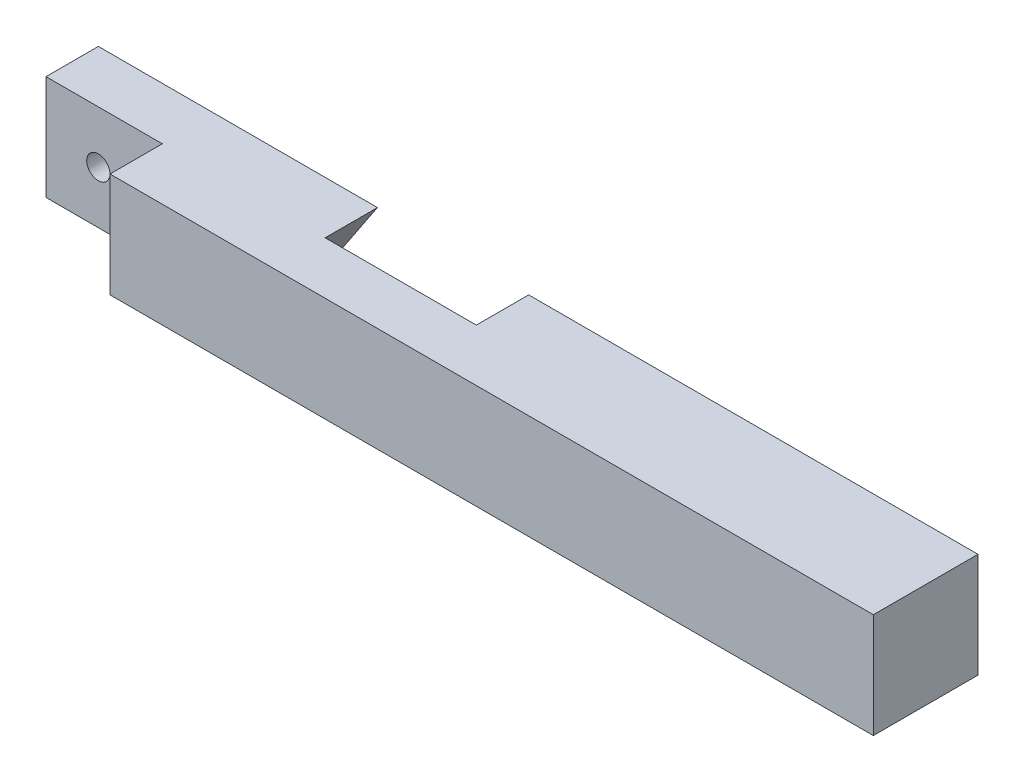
from build123d import *

# Parameters (mm, degrees)
ESQUISSE1_W             = 75.63
ESQUISSE1_H             = 9
EXTRUSION1_DEPTH        = 9
ESQUISSE2_W             = 10
ESQUISSE2_H             = 9
ENL_V_MAT_EXTRU_1_DEPTH = 4.5
ESQUISSE3_R             = 1
ENL_V_MAT_EXTRU_2_DEPTH = 4.5
ENL_V_MAT_EXTRU_3_DEPTH = 4.5


with BuildPart() as part:
    # Esquisse1 → Extrusion1 (new body)
    with BuildSketch(Plane.XY):
        with Locations((37.815, 4.5)):
            Rectangle(ESQUISSE1_W, ESQUISSE1_H)
    extrude(amount=EXTRUSION1_DEPTH)

    # Esquisse2 → Enl_v. mat.-Extru.1 (cut)
    with BuildSketch(Plane.XY.offset(9)):
        with Locations((5, 4.5)):
            Rectangle(ESQUISSE2_W, ESQUISSE2_H)
    extrude(amount=-ENL_V_MAT_EXTRU_1_DEPTH, mode=Mode.SUBTRACT)

    # Esquisse3 → Enl_v. mat.-Extru.2 (cut)
    with BuildSketch(Plane.XY.offset(4.5)):
        with Locations((4.5, 4.5)):
            Circle(ESQUISSE3_R)
    extrude(amount=-ENL_V_MAT_EXTRU_2_DEPTH, mode=Mode.SUBTRACT)

    # Esquisse4 → Enl_v. mat.-Extru.3 (cut)
    with BuildSketch(Plane(origin=(0, 0, 0), x_dir=(-1, 0, 0), z_dir=(0, 0, -1))):
        Polygon((-18, 0), (-24, 9), (-37, 9), (-31, 0), align=None)
    extrude(amount=-ENL_V_MAT_EXTRU_3_DEPTH, mode=Mode.SUBTRACT)


solid = part.part
